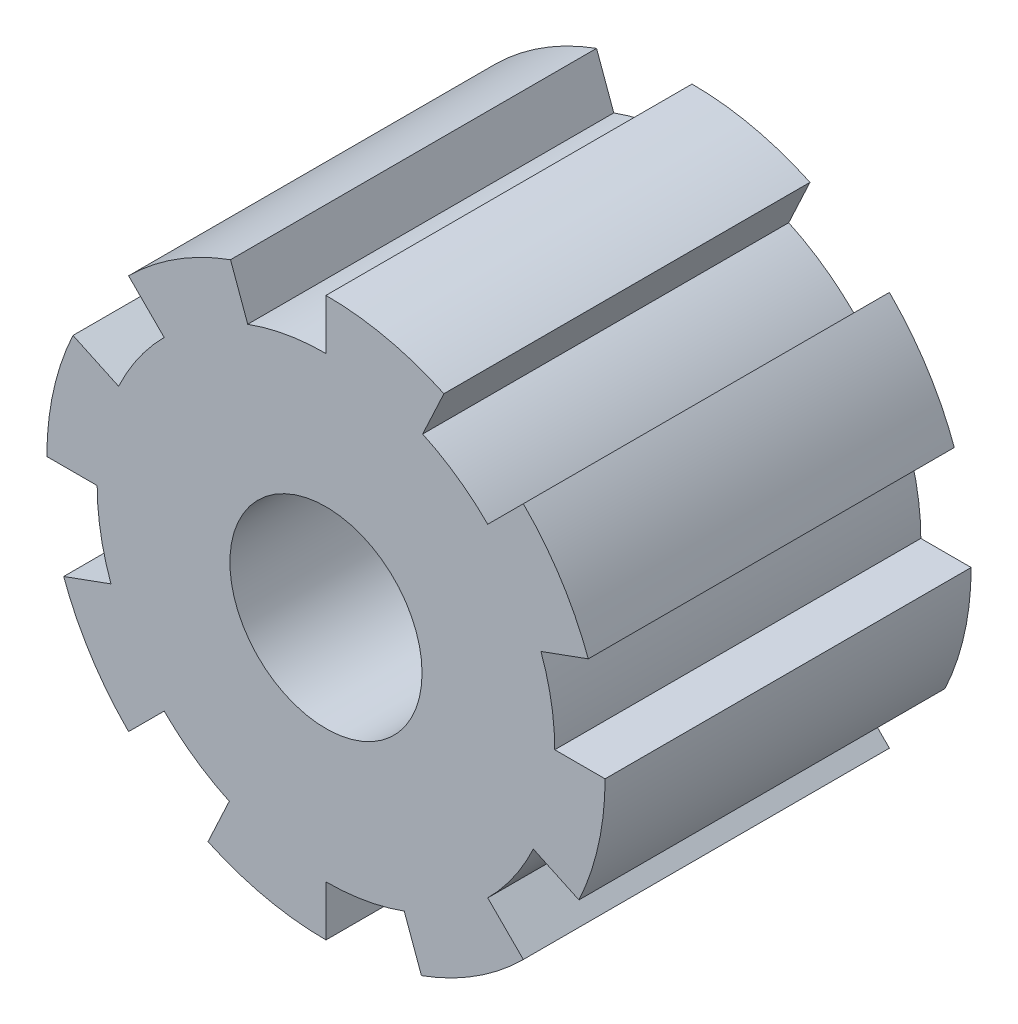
from build123d import *

# Parameters (mm, degrees)
ESQUISSE1_R                  = 5
BOSS_EXTRU_1_DEPTH           = 8
BOSS_EXTRU_2_DEPTH           = 8
R_P_TITION_CIRCULAIRE1_COUNT = 8
TROU_TARAUD_M51_D            = 4.2


with BuildPart() as part:
    # Esquisse1 → Boss.-Extru.1 (new body)
    with BuildSketch(Plane.XY):
        Circle(ESQUISSE1_R)
    extrude(amount=BOSS_EXTRU_1_DEPTH)

    # Esquisse2 → Boss.-Extru.2 (add)
    with BuildSketch(Plane.XY.offset(8)):
        with BuildLine():
            Line((0, 0), (-6.1, 0))
            ThreePointArc((-6.1, 0), (-5.955405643, 1.320281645), (-5.528477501, 2.577971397))
            Line((-5.528477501, 2.577971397), (0, 0))
        make_face()
    boss_extru_2 = extrude(amount=-BOSS_EXTRU_2_DEPTH)

    # R_p_tition circulaire1: Boss.-Extru.2 ×8 about axis
    r_p_tition_circulaire1_axis = Axis((0, 0, 0), (0, 0, 1))
    for i in range(1, R_P_TITION_CIRCULAIRE1_COUNT):
        add(boss_extru_2.rotate(r_p_tition_circulaire1_axis, i * 360 / R_P_TITION_CIRCULAIRE1_COUNT))

    # Trou taraud_ M51 (through all)
    with Locations(Plane.XY.offset(8)):
        with Locations((0, 0)):
            Hole(TROU_TARAUD_M51_D / 2)


solid = part.part
